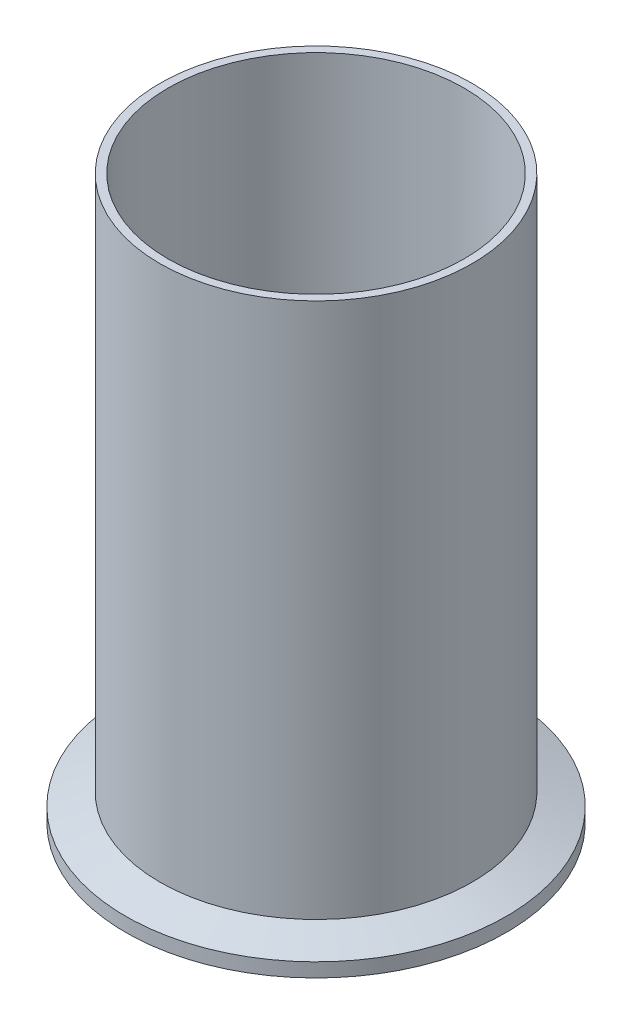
ISO-10303-21;
HEADER;
FILE_DESCRIPTION(('STEP AP214'),'2;1');
FILE_NAME('part.step','',(''),(''),'','','');
FILE_SCHEMA(('AUTOMOTIVE_DESIGN { 1 0 10303 214 1 1 1 1 }'));
ENDSEC;
DATA;
#1=APPLICATION_CONTEXT('core data for automotive mechanical design processes');
#2=APPLICATION_PROTOCOL_DEFINITION('international standard','automotive_design',2000,#1);
#3=PRODUCT_CONTEXT('',#1,'mechanical');
#4=PRODUCT('Part','Part','',(#3));
#5=PRODUCT_RELATED_PRODUCT_CATEGORY('part','',(#4));
#6=PRODUCT_DEFINITION_FORMATION('','',#4);
#7=PRODUCT_DEFINITION_CONTEXT('part definition',#1,'design');
#8=PRODUCT_DEFINITION('design','',#6,#7);
#9=PRODUCT_DEFINITION_SHAPE('','',#8);
#10=(LENGTH_UNIT() NAMED_UNIT(*) SI_UNIT(.MILLI.,.METRE.));
#11=(NAMED_UNIT(*) PLANE_ANGLE_UNIT() SI_UNIT($,.RADIAN.));
#12=(NAMED_UNIT(*) SI_UNIT($,.STERADIAN.) SOLID_ANGLE_UNIT());
#13=UNCERTAINTY_MEASURE_WITH_UNIT(LENGTH_MEASURE(1.E-05),#10,'distance_accuracy_value','');
#14=(GEOMETRIC_REPRESENTATION_CONTEXT(3) GLOBAL_UNCERTAINTY_ASSIGNED_CONTEXT((#13)) GLOBAL_UNIT_ASSIGNED_CONTEXT((#10,
#11,#12)) REPRESENTATION_CONTEXT('',''));
#15=CARTESIAN_POINT('',(0.,0.,0.));
#16=DIRECTION('',(0.,0.,1.));
#17=DIRECTION('',(1.,0.,0.));
#18=AXIS2_PLACEMENT_3D('',#15,#16,#17);
#19=CARTESIAN_POINT('',(0.,0.7874,0.));
#20=DIRECTION('',(0.,-1.,0.));
#21=DIRECTION('',(0.,0.,-1.));
#22=AXIS2_PLACEMENT_3D('',#19,#20,#21);
#23=TOROIDAL_SURFACE('',#22,37.1367084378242,0.787400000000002);
#24=CARTESIAN_POINT('',(0.,0.,0.));
#25=DIRECTION('',(0.,-1.,0.));
#26=DIRECTION('',(0.,0.,-1.));
#27=AXIS2_PLACEMENT_3D('',#24,#25,#26);
#28=CIRCLE('',#27,37.1367084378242);
#29=CARTESIAN_POINT('',(0.,0.,-37.1367084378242));
#30=VERTEX_POINT('',#29);
#31=EDGE_CURVE('E67',#30,#30,#28,.T.);
#32=ORIENTED_EDGE('',*,*,#31,.T.);
#33=EDGE_LOOP('',(#32));
#34=FACE_BOUND('',#33,.T.);
#35=CARTESIAN_POINT('',(0.,0.474458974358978,0.));
#36=DIRECTION('',(0.,-1.,0.));
#37=DIRECTION('',(0.,0.,-1.));
#38=AXIS2_PLACEMENT_3D('',#35,#36,#37);
#39=CIRCLE('',#38,36.4141666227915);
#40=CARTESIAN_POINT('',(0.,0.474458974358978,-36.4141666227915));
#41=VERTEX_POINT('',#40);
#42=EDGE_CURVE('E10',#41,#41,#39,.T.);
#43=ORIENTED_EDGE('',*,*,#42,.F.);
#44=EDGE_LOOP('',(#43));
#45=FACE_BOUND('',#44,.T.);
#46=ADVANCED_FACE('F33',(#34,#45),#23,.T.);
#47=CARTESIAN_POINT('',(0.,0.,0.));
#48=DIRECTION('',(0.,-1.,0.));
#49=DIRECTION('',(0.,0.,-1.));
#50=AXIS2_PLACEMENT_3D('',#47,#48,#49);
#51=TOROIDAL_SURFACE('',#50,35.3187,1.1938);
#52=CARTESIAN_POINT('',(0.,0.474458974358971,0.));
#53=DIRECTION('',(0.,-1.,0.));
#54=DIRECTION('',(0.,0.,-1.));
#55=AXIS2_PLACEMENT_3D('',#52,#53,#54);
#56=CIRCLE('',#55,34.2232333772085);
#57=CARTESIAN_POINT('',(0.,0.474458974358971,-34.2232333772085));
#58=VERTEX_POINT('',#57);
#59=EDGE_CURVE('E39',#58,#58,#56,.T.);
#60=ORIENTED_EDGE('',*,*,#59,.F.);
#61=EDGE_LOOP('',(#60));
#62=FACE_BOUND('',#61,.T.);
#63=ORIENTED_EDGE('',*,*,#42,.T.);
#64=EDGE_LOOP('',(#63));
#65=FACE_BOUND('',#64,.T.);
#66=ADVANCED_FACE('F115',(#62,#65),#51,.F.);
#67=CARTESIAN_POINT('',(0.,0.7874,0.));
#68=DIRECTION('',(0.,-1.,0.));
#69=DIRECTION('',(0.,0.,-1.));
#70=AXIS2_PLACEMENT_3D('',#67,#68,#69);
#71=TOROIDAL_SURFACE('',#70,33.5006915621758,0.787399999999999);
#72=ORIENTED_EDGE('',*,*,#59,.T.);
#73=EDGE_LOOP('',(#72));
#74=FACE_BOUND('',#73,.T.);
#75=CARTESIAN_POINT('',(0.,0.,0.));
#76=DIRECTION('',(0.,-1.,0.));
#77=DIRECTION('',(0.,0.,-1.));
#78=AXIS2_PLACEMENT_3D('',#75,#76,#77);
#79=CIRCLE('',#78,33.5006915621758);
#80=CARTESIAN_POINT('',(0.,0.,-33.5006915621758));
#81=VERTEX_POINT('',#80);
#82=EDGE_CURVE('E43',#81,#81,#79,.T.);
#83=ORIENTED_EDGE('',*,*,#82,.F.);
#84=EDGE_LOOP('',(#83));
#85=FACE_BOUND('',#84,.T.);
#86=ADVANCED_FACE('F111',(#74,#85),#71,.T.);
#87=CARTESIAN_POINT('',(0.,0.,0.));
#88=DIRECTION('',(0.,1.,0.));
#89=DIRECTION('',(0.,0.,1.));
#90=AXIS2_PLACEMENT_3D('',#87,#88,#89);
#91=PLANE('',#90);
#92=CARTESIAN_POINT('',(0.,0.,0.));
#93=DIRECTION('',(0.,-1.,0.));
#94=DIRECTION('',(0.,0.,-1.));
#95=AXIS2_PLACEMENT_3D('',#92,#93,#94);
#96=CIRCLE('',#95,30.099);
#97=CARTESIAN_POINT('',(0.,0.,-30.099));
#98=VERTEX_POINT('',#97);
#99=EDGE_CURVE('E47',#98,#98,#96,.T.);
#100=ORIENTED_EDGE('',*,*,#99,.F.);
#101=EDGE_LOOP('',(#100));
#102=FACE_BOUND('',#101,.T.);
#103=ORIENTED_EDGE('',*,*,#82,.T.);
#104=EDGE_LOOP('',(#103));
#105=FACE_BOUND('',#104,.T.);
#106=ADVANCED_FACE('F105',(#102,#105),#91,.F.);
#107=CARTESIAN_POINT('',(0.,0.,0.));
#108=DIRECTION('',(0.,-1.,0.));
#109=DIRECTION('',(0.,0.,-1.));
#110=AXIS2_PLACEMENT_3D('',#107,#108,#109);
#111=CYLINDRICAL_SURFACE('',#110,30.099);
#112=ORIENTED_EDGE('',*,*,#99,.T.);
#113=EDGE_LOOP('',(#112));
#114=FACE_BOUND('',#113,.T.);
#115=CARTESIAN_POINT('',(0.,114.3,0.));
#116=DIRECTION('',(0.,-1.,0.));
#117=DIRECTION('',(0.,0.,-1.));
#118=AXIS2_PLACEMENT_3D('',#115,#116,#117);
#119=CIRCLE('',#118,30.099);
#120=CARTESIAN_POINT('',(0.,114.3,-30.099));
#121=VERTEX_POINT('',#120);
#122=EDGE_CURVE('E52',#121,#121,#119,.T.);
#123=ORIENTED_EDGE('',*,*,#122,.F.);
#124=EDGE_LOOP('',(#123));
#125=FACE_BOUND('',#124,.T.);
#126=ADVANCED_FACE('F100',(#114,#125),#111,.F.);
#127=CARTESIAN_POINT('',(0.,114.3,0.));
#128=DIRECTION('',(0.,-1.,0.));
#129=DIRECTION('',(0.,0.,-1.));
#130=AXIS2_PLACEMENT_3D('',#127,#128,#129);
#131=PLANE('',#130);
#132=CARTESIAN_POINT('',(0.,114.3,0.));
#133=DIRECTION('',(0.,-1.,0.));
#134=DIRECTION('',(0.,0.,-1.));
#135=AXIS2_PLACEMENT_3D('',#132,#133,#134);
#136=CIRCLE('',#135,31.75);
#137=CARTESIAN_POINT('',(0.,114.3,-31.75));
#138=VERTEX_POINT('',#137);
#139=EDGE_CURVE('E55',#138,#138,#136,.T.);
#140=ORIENTED_EDGE('',*,*,#139,.F.);
#141=EDGE_LOOP('',(#140));
#142=FACE_BOUND('',#141,.T.);
#143=ORIENTED_EDGE('',*,*,#122,.T.);
#144=EDGE_LOOP('',(#143));
#145=FACE_BOUND('',#144,.T.);
#146=ADVANCED_FACE('F94',(#142,#145),#131,.F.);
#147=CARTESIAN_POINT('',(0.,0.,0.));
#148=DIRECTION('',(0.,-1.,0.));
#149=DIRECTION('',(0.,0.,-1.));
#150=AXIS2_PLACEMENT_3D('',#147,#148,#149);
#151=CYLINDRICAL_SURFACE('',#150,31.75);
#152=CARTESIAN_POINT('',(0.,5.37788724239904,0.));
#153=DIRECTION('',(0.,-1.,0.));
#154=DIRECTION('',(0.,0.,-1.));
#155=AXIS2_PLACEMENT_3D('',#152,#153,#154);
#156=CIRCLE('',#155,31.75);
#157=CARTESIAN_POINT('',(0.,5.37788724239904,-31.75));
#158=VERTEX_POINT('',#157);
#159=EDGE_CURVE('E58',#158,#158,#156,.T.);
#160=ORIENTED_EDGE('',*,*,#159,.F.);
#161=EDGE_LOOP('',(#160));
#162=FACE_BOUND('',#161,.T.);
#163=ORIENTED_EDGE('',*,*,#139,.T.);
#164=EDGE_LOOP('',(#163));
#165=FACE_BOUND('',#164,.T.);
#166=ADVANCED_FACE('F88',(#162,#165),#151,.T.);
#167=CARTESIAN_POINT('',(0.,5.37788724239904,0.));
#168=DIRECTION('',(0.,-1.,0.));
#169=DIRECTION('',(0.,0.,-1.));
#170=AXIS2_PLACEMENT_3D('',#167,#168,#169);
#171=CONICAL_SURFACE('',#170,31.75,1.22173047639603);
#172=CARTESIAN_POINT('',(0.,2.8448,0.));
#173=DIRECTION('',(0.,-1.,0.));
#174=DIRECTION('',(0.,0.,-1.));
#175=AXIS2_PLACEMENT_3D('',#172,#173,#174);
#176=CIRCLE('',#175,38.7096);
#177=CARTESIAN_POINT('',(0.,2.8448,-38.7096));
#178=VERTEX_POINT('',#177);
#179=EDGE_CURVE('E61',#178,#178,#176,.T.);
#180=ORIENTED_EDGE('',*,*,#179,.F.);
#181=EDGE_LOOP('',(#180));
#182=FACE_BOUND('',#181,.T.);
#183=ORIENTED_EDGE('',*,*,#159,.T.);
#184=EDGE_LOOP('',(#183));
#185=FACE_BOUND('',#184,.T.);
#186=ADVANCED_FACE('F82',(#182,#185),#171,.T.);
#187=CARTESIAN_POINT('',(0.,0.,0.));
#188=DIRECTION('',(0.,-1.,0.));
#189=DIRECTION('',(0.,0.,-1.));
#190=AXIS2_PLACEMENT_3D('',#187,#188,#189);
#191=CYLINDRICAL_SURFACE('',#190,38.7096);
#192=CARTESIAN_POINT('',(0.,0.,0.));
#193=DIRECTION('',(0.,-1.,0.));
#194=DIRECTION('',(0.,0.,-1.));
#195=AXIS2_PLACEMENT_3D('',#192,#193,#194);
#196=CIRCLE('',#195,38.7096);
#197=CARTESIAN_POINT('',(0.,0.,-38.7096));
#198=VERTEX_POINT('',#197);
#199=EDGE_CURVE('E64',#198,#198,#196,.T.);
#200=ORIENTED_EDGE('',*,*,#199,.F.);
#201=EDGE_LOOP('',(#200));
#202=FACE_BOUND('',#201,.T.);
#203=ORIENTED_EDGE('',*,*,#179,.T.);
#204=EDGE_LOOP('',(#203));
#205=FACE_BOUND('',#204,.T.);
#206=ADVANCED_FACE('F76',(#202,#205),#191,.T.);
#207=CARTESIAN_POINT('',(0.,0.,0.));
#208=DIRECTION('',(0.,1.,0.));
#209=DIRECTION('',(0.,0.,1.));
#210=AXIS2_PLACEMENT_3D('',#207,#208,#209);
#211=PLANE('',#210);
#212=ORIENTED_EDGE('',*,*,#31,.F.);
#213=EDGE_LOOP('',(#212));
#214=FACE_BOUND('',#213,.T.);
#215=ORIENTED_EDGE('',*,*,#199,.T.);
#216=EDGE_LOOP('',(#215));
#217=FACE_BOUND('',#216,.T.);
#218=ADVANCED_FACE('F73',(#214,#217),#211,.F.);
#219=CLOSED_SHELL('',(#46,#66,#86,#106,#126,#146,#166,#186,#206,#218));
#220=MANIFOLD_SOLID_BREP('B2',#219);
#221=ADVANCED_BREP_SHAPE_REPRESENTATION('',(#18,#220),#14);
#222=SHAPE_DEFINITION_REPRESENTATION(#9,#221);
ENDSEC;
END-ISO-10303-21;
